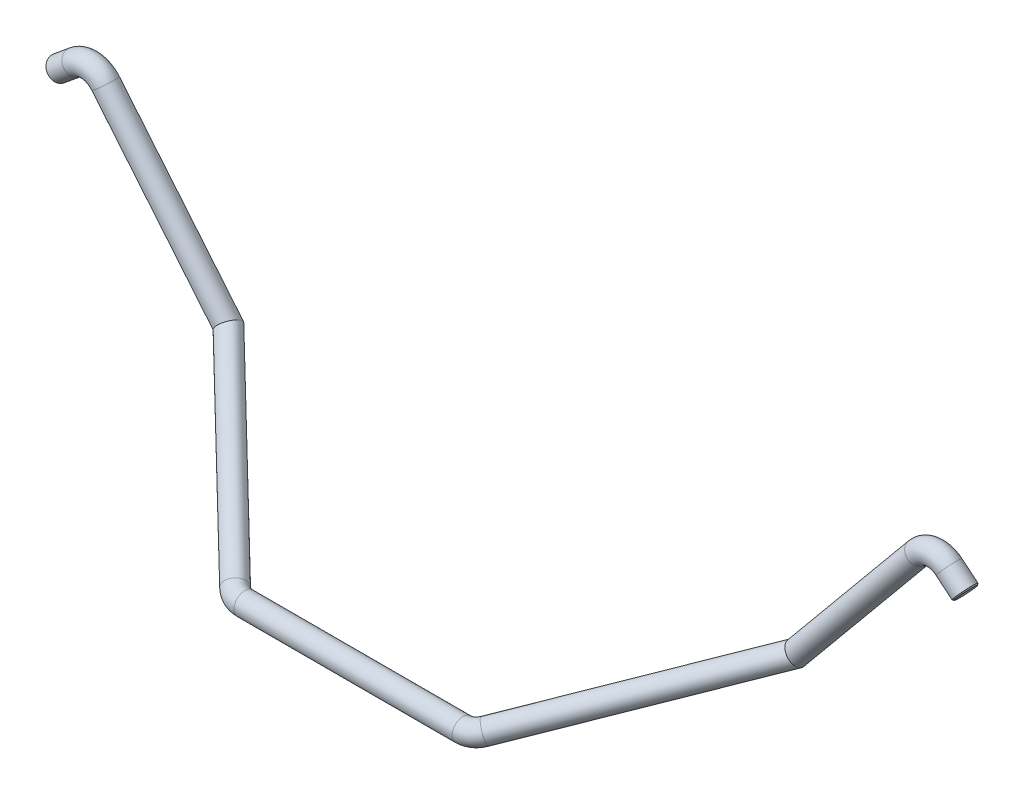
ISO-10303-21;
HEADER;
FILE_DESCRIPTION(('STEP AP214'),'2;1');
FILE_NAME('part.step','',(''),(''),'','','');
FILE_SCHEMA(('AUTOMOTIVE_DESIGN { 1 0 10303 214 1 1 1 1 }'));
ENDSEC;
DATA;
#1=APPLICATION_CONTEXT('core data for automotive mechanical design processes');
#2=APPLICATION_PROTOCOL_DEFINITION('international standard','automotive_design',2000,#1);
#3=PRODUCT_CONTEXT('',#1,'mechanical');
#4=PRODUCT('Part','Part','',(#3));
#5=PRODUCT_RELATED_PRODUCT_CATEGORY('part','',(#4));
#6=PRODUCT_DEFINITION_FORMATION('','',#4);
#7=PRODUCT_DEFINITION_CONTEXT('part definition',#1,'design');
#8=PRODUCT_DEFINITION('design','',#6,#7);
#9=PRODUCT_DEFINITION_SHAPE('','',#8);
#10=(LENGTH_UNIT() NAMED_UNIT(*) SI_UNIT(.MILLI.,.METRE.));
#11=(NAMED_UNIT(*) PLANE_ANGLE_UNIT() SI_UNIT($,.RADIAN.));
#12=(NAMED_UNIT(*) SI_UNIT($,.STERADIAN.) SOLID_ANGLE_UNIT());
#13=UNCERTAINTY_MEASURE_WITH_UNIT(LENGTH_MEASURE(1.E-05),#10,'distance_accuracy_value','');
#14=(GEOMETRIC_REPRESENTATION_CONTEXT(3) GLOBAL_UNCERTAINTY_ASSIGNED_CONTEXT((#13)) GLOBAL_UNIT_ASSIGNED_CONTEXT((#10,
#11,#12)) REPRESENTATION_CONTEXT('',''));
#15=CARTESIAN_POINT('',(0.,0.,0.));
#16=DIRECTION('',(0.,0.,1.));
#17=DIRECTION('',(1.,0.,0.));
#18=AXIS2_PLACEMENT_3D('',#15,#16,#17);
#19=CARTESIAN_POINT('',(-200.371713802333,69.427221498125,0.));
#20=DIRECTION('',(-0.770722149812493,-0.6371713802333,0.));
#21=DIRECTION('',(0.6371713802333,-0.770722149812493,0.));
#22=AXIS2_PLACEMENT_3D('',#19,#20,#21);
#23=CYLINDRICAL_SURFACE('',#22,5.);
#24=CARTESIAN_POINT('',(-207.693574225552,63.3740933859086,0.));
#25=DIRECTION('',(-0.770722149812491,-0.637171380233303,0.));
#26=DIRECTION('',(0.637171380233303,-0.770722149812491,0.));
#27=AXIS2_PLACEMENT_3D('',#24,#25,#26);
#28=CIRCLE('',#27,5.);
#29=CARTESIAN_POINT('',(-204.507717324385,59.5204826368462,0.));
#30=VERTEX_POINT('',#29);
#31=EDGE_CURVE('E34',#30,#30,#28,.F.);
#32=ORIENTED_EDGE('',*,*,#31,.T.);
#33=EDGE_LOOP('',(#32));
#34=FACE_BOUND('',#33,.T.);
#35=CARTESIAN_POINT('',(-200.371713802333,69.427221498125,0.));
#36=DIRECTION('',(-0.770722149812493,-0.6371713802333,0.));
#37=DIRECTION('',(0.6371713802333,-0.770722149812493,0.));
#38=AXIS2_PLACEMENT_3D('',#35,#36,#37);
#39=CIRCLE('',#38,5.);
#40=CARTESIAN_POINT('',(-203.5575707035,73.2808322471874,0.));
#41=VERTEX_POINT('',#40);
#42=EDGE_CURVE('E47',#41,#41,#39,.F.);
#43=ORIENTED_EDGE('',*,*,#42,.F.);
#44=EDGE_LOOP('',(#43));
#45=FACE_BOUND('',#44,.T.);
#46=ADVANCED_FACE('F28',(#34,#45),#23,.T.);
#47=CARTESIAN_POINT('',(-194.,61.72,0.));
#48=DIRECTION('',(0.,0.,1.));
#49=DIRECTION('',(1.,0.,0.));
#50=AXIS2_PLACEMENT_3D('',#47,#48,#49);
#51=TOROIDAL_SURFACE('',#50,10.,5.);
#52=CARTESIAN_POINT('',(-186.292778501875,68.091713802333,0.));
#53=DIRECTION('',(-0.637171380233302,0.770722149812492,0.));
#54=DIRECTION('',(-0.770722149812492,-0.637171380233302,0.));
#55=AXIS2_PLACEMENT_3D('',#52,#53,#54);
#56=CIRCLE('',#55,5.);
#57=CARTESIAN_POINT('',(-182.439167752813,71.2775707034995,0.));
#58=VERTEX_POINT('',#57);
#59=EDGE_CURVE('E50',#58,#58,#56,.F.);
#60=CARTESIAN_POINT('',(-194.,61.72,0.));
#61=DIRECTION('',(0.,0.,1.));
#62=DIRECTION('',(1.,0.,0.));
#63=AXIS2_PLACEMENT_3D('',#60,#61,#62);
#64=CIRCLE('',#63,15.);
#65=EDGE_CURVE('',#58,#41,#64,.T.);
#66=ORIENTED_EDGE('',*,*,#59,.F.);
#67=ORIENTED_EDGE('',*,*,#42,.T.);
#68=ORIENTED_EDGE('',*,*,#65,.T.);
#69=ORIENTED_EDGE('',*,*,#65,.F.);
#70=EDGE_LOOP('',(#66,#68,#67,#69));
#71=FACE_BOUND('',#70,.T.);
#72=ADVANCED_FACE('F125',(#71),#51,.T.);
#73=CARTESIAN_POINT('',(-130.,0.,0.));
#74=DIRECTION('',(-0.637171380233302,0.770722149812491,0.));
#75=DIRECTION('',(-0.770722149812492,-0.637171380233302,0.));
#76=AXIS2_PLACEMENT_3D('',#73,#74,#75);
#77=CYLINDRICAL_SURFACE('',#76,5.);
#78=CARTESIAN_POINT('',(-130.,0.,0.));
#79=DIRECTION('',(-0.723735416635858,0.588896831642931,-0.359732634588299));
#80=DIRECTION('',(-0.0621216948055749,-0.574775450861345,-0.815949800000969));
#81=AXIS2_PLACEMENT_3D('',#78,#79,#80);
#82=ELLIPSE('',#81,5.46436545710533,5.);
#83=CARTESIAN_POINT('',(-130.339455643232,-3.14078311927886,-4.4586479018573));
#84=VERTEX_POINT('',#83);
#85=EDGE_CURVE('E53',#84,#84,#82,.T.);
#86=ORIENTED_EDGE('',*,*,#85,.T.);
#87=EDGE_LOOP('',(#86));
#88=FACE_BOUND('',#87,.T.);
#89=ORIENTED_EDGE('',*,*,#59,.T.);
#90=EDGE_LOOP('',(#89));
#91=FACE_BOUND('',#90,.T.);
#92=ADVANCED_FACE('F119',(#88,#91),#77,.T.);
#93=CARTESIAN_POINT('',(-57.2638085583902,-32.4879015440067,69.670529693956));
#94=DIRECTION('',(-0.687292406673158,0.306981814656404,-0.658324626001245));
#95=DIRECTION('',(-0.69172426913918,0.,0.722161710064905));
#96=AXIS2_PLACEMENT_3D('',#93,#94,#95);
#97=CYLINDRICAL_SURFACE('',#96,5.);
#98=CARTESIAN_POINT('',(-57.2638085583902,-32.4879015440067,69.670529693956));
#99=DIRECTION('',(-0.687292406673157,0.306981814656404,-0.658324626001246));
#100=DIRECTION('',(-0.69172426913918,0.,0.722161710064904));
#101=AXIS2_PLACEMENT_3D('',#98,#99,#100);
#102=CIRCLE('',#101,5.);
#103=CARTESIAN_POINT('',(-60.8957128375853,-33.9402131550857,72.7850219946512));
#104=VERTEX_POINT('',#103);
#105=EDGE_CURVE('E56',#104,#104,#102,.F.);
#106=ORIENTED_EDGE('',*,*,#105,.F.);
#107=EDGE_LOOP('',(#106));
#108=FACE_BOUND('',#107,.T.);
#109=ORIENTED_EDGE('',*,*,#85,.F.);
#110=EDGE_LOOP('',(#109));
#111=FACE_BOUND('',#110,.T.);
#112=ADVANCED_FACE('F113',(#108,#111),#97,.T.);
#113=CARTESIAN_POINT('',(-50.,-29.5832783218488,63.4415450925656));
#114=DIRECTION('',(0.,-0.906307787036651,-0.422618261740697));
#115=DIRECTION('',(0.,0.422618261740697,-0.906307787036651));
#116=AXIS2_PLACEMENT_3D('',#113,#114,#115);
#117=TOROIDAL_SURFACE('',#116,10.,5.);
#118=CARTESIAN_POINT('',(-50.,-33.8094609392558,72.5046229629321));
#119=DIRECTION('',(-1.,0.,0.));
#120=DIRECTION('',(0.,-0.125850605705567,0.992049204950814));
#121=AXIS2_PLACEMENT_3D('',#118,#119,#120);
#122=CIRCLE('',#121,5.);
#123=CARTESIAN_POINT('',(-50.,-35.9225522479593,77.0361618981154));
#124=VERTEX_POINT('',#123);
#125=EDGE_CURVE('E59',#124,#124,#122,.F.);
#126=CARTESIAN_POINT('',(-50.,-29.5832783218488,63.4415450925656));
#127=DIRECTION('',(0.,-0.906307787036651,-0.422618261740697));
#128=DIRECTION('',(0.,0.422618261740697,-0.906307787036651));
#129=AXIS2_PLACEMENT_3D('',#126,#127,#128);
#130=CIRCLE('',#129,15.);
#131=EDGE_CURVE('',#124,#104,#130,.T.);
#132=ORIENTED_EDGE('',*,*,#125,.F.);
#133=ORIENTED_EDGE('',*,*,#105,.T.);
#134=ORIENTED_EDGE('',*,*,#131,.T.);
#135=ORIENTED_EDGE('',*,*,#131,.F.);
#136=EDGE_LOOP('',(#132,#134,#133,#135));
#137=FACE_BOUND('',#136,.T.);
#138=ADVANCED_FACE('F107',(#137),#117,.T.);
#139=CARTESIAN_POINT('',(50.,-33.8094609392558,72.5046229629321));
#140=DIRECTION('',(-1.,0.,0.));
#141=DIRECTION('',(0.,-1.,0.));
#142=AXIS2_PLACEMENT_3D('',#139,#140,#141);
#143=CYLINDRICAL_SURFACE('',#142,5.);
#144=CARTESIAN_POINT('',(50.,-33.8094609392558,72.5046229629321));
#145=DIRECTION('',(-1.,0.,0.));
#146=DIRECTION('',(0.,-0.125850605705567,0.992049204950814));
#147=AXIS2_PLACEMENT_3D('',#144,#145,#146);
#148=CIRCLE('',#147,5.);
#149=CARTESIAN_POINT('',(50.,-35.9225522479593,77.0361618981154));
#150=VERTEX_POINT('',#149);
#151=EDGE_CURVE('E62',#150,#150,#148,.F.);
#152=ORIENTED_EDGE('',*,*,#151,.F.);
#153=EDGE_LOOP('',(#152));
#154=FACE_BOUND('',#153,.T.);
#155=ORIENTED_EDGE('',*,*,#125,.T.);
#156=EDGE_LOOP('',(#155));
#157=FACE_BOUND('',#156,.T.);
#158=ADVANCED_FACE('F101',(#154,#157),#143,.T.);
#159=CARTESIAN_POINT('',(50.,-29.5832783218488,63.4415450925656));
#160=DIRECTION('',(0.,-0.906307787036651,-0.422618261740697));
#161=DIRECTION('',(0.,0.422618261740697,-0.906307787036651));
#162=AXIS2_PLACEMENT_3D('',#159,#160,#161);
#163=TOROIDAL_SURFACE('',#162,10.,5.);
#164=CARTESIAN_POINT('',(57.2638085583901,-32.4879015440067,69.670529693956));
#165=DIRECTION('',(-0.687292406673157,-0.306981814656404,0.658324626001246));
#166=DIRECTION('',(0.69172426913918,0.,0.722161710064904));
#167=AXIS2_PLACEMENT_3D('',#164,#165,#166);
#168=CIRCLE('',#167,5.);
#169=CARTESIAN_POINT('',(60.8957128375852,-33.9402131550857,72.7850219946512));
#170=VERTEX_POINT('',#169);
#171=EDGE_CURVE('E65',#170,#170,#168,.F.);
#172=CARTESIAN_POINT('',(50.,-29.5832783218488,63.4415450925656));
#173=DIRECTION('',(0.,-0.906307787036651,-0.422618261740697));
#174=DIRECTION('',(0.,0.422618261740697,-0.906307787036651));
#175=AXIS2_PLACEMENT_3D('',#172,#173,#174);
#176=CIRCLE('',#175,15.);
#177=EDGE_CURVE('',#170,#150,#176,.T.);
#178=ORIENTED_EDGE('',*,*,#171,.F.);
#179=ORIENTED_EDGE('',*,*,#151,.T.);
#180=ORIENTED_EDGE('',*,*,#177,.T.);
#181=ORIENTED_EDGE('',*,*,#177,.F.);
#182=EDGE_LOOP('',(#178,#180,#179,#181));
#183=FACE_BOUND('',#182,.T.);
#184=ADVANCED_FACE('F95',(#183),#163,.T.);
#185=CARTESIAN_POINT('',(130.,0.,0.));
#186=DIRECTION('',(-0.687292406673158,-0.306981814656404,0.658324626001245));
#187=DIRECTION('',(0.69172426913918,0.,0.722161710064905));
#188=AXIS2_PLACEMENT_3D('',#185,#186,#187);
#189=CYLINDRICAL_SURFACE('',#188,5.);
#190=CARTESIAN_POINT('',(130.,0.,0.));
#191=DIRECTION('',(-0.723735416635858,-0.58889683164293,0.359732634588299));
#192=DIRECTION('',(0.0621216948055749,-0.574775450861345,-0.815949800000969));
#193=AXIS2_PLACEMENT_3D('',#190,#191,#192);
#194=ELLIPSE('',#193,5.46436545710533,5.);
#195=CARTESIAN_POINT('',(130.339455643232,-3.14078311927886,-4.45864790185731));
#196=VERTEX_POINT('',#195);
#197=EDGE_CURVE('E68',#196,#196,#194,.T.);
#198=ORIENTED_EDGE('',*,*,#197,.T.);
#199=EDGE_LOOP('',(#198));
#200=FACE_BOUND('',#199,.T.);
#201=ORIENTED_EDGE('',*,*,#171,.T.);
#202=EDGE_LOOP('',(#201));
#203=FACE_BOUND('',#202,.T.);
#204=ADVANCED_FACE('F89',(#200,#203),#189,.T.);
#205=CARTESIAN_POINT('',(186.292778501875,68.0917138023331,0.));
#206=DIRECTION('',(-0.637171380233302,-0.770722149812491,0.));
#207=DIRECTION('',(0.770722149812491,-0.637171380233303,0.));
#208=AXIS2_PLACEMENT_3D('',#205,#206,#207);
#209=CYLINDRICAL_SURFACE('',#208,5.);
#210=CARTESIAN_POINT('',(186.292778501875,68.0917138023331,0.));
#211=DIRECTION('',(0.637171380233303,0.770722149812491,0.));
#212=DIRECTION('',(-0.770722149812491,0.637171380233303,0.));
#213=AXIS2_PLACEMENT_3D('',#210,#211,#212);
#214=CIRCLE('',#213,5.);
#215=CARTESIAN_POINT('',(182.439167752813,71.2775707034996,0.));
#216=VERTEX_POINT('',#215);
#217=EDGE_CURVE('E71',#216,#216,#214,.T.);
#218=ORIENTED_EDGE('',*,*,#217,.F.);
#219=EDGE_LOOP('',(#218));
#220=FACE_BOUND('',#219,.T.);
#221=ORIENTED_EDGE('',*,*,#197,.F.);
#222=EDGE_LOOP('',(#221));
#223=FACE_BOUND('',#222,.T.);
#224=ADVANCED_FACE('F83',(#220,#223),#209,.T.);
#225=CARTESIAN_POINT('',(194.,61.72,0.));
#226=DIRECTION('',(0.,0.,1.));
#227=DIRECTION('',(1.,0.,0.));
#228=AXIS2_PLACEMENT_3D('',#225,#226,#227);
#229=TOROIDAL_SURFACE('',#228,10.,5.);
#230=CARTESIAN_POINT('',(200.371713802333,69.4272214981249,0.));
#231=DIRECTION('',(0.77072214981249,-0.637171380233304,0.));
#232=DIRECTION('',(0.637171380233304,0.77072214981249,0.));
#233=AXIS2_PLACEMENT_3D('',#230,#231,#232);
#234=CIRCLE('',#233,5.);
#235=CARTESIAN_POINT('',(203.5575707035,73.2808322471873,0.));
#236=VERTEX_POINT('',#235);
#237=EDGE_CURVE('E74',#236,#236,#234,.T.);
#238=CARTESIAN_POINT('',(194.,61.72,0.));
#239=DIRECTION('',(0.,0.,1.));
#240=DIRECTION('',(1.,0.,0.));
#241=AXIS2_PLACEMENT_3D('',#238,#239,#240);
#242=CIRCLE('',#241,15.);
#243=EDGE_CURVE('',#236,#216,#242,.T.);
#244=ORIENTED_EDGE('',*,*,#237,.F.);
#245=ORIENTED_EDGE('',*,*,#217,.T.);
#246=ORIENTED_EDGE('',*,*,#243,.T.);
#247=ORIENTED_EDGE('',*,*,#243,.F.);
#248=EDGE_LOOP('',(#244,#246,#245,#247));
#249=FACE_BOUND('',#248,.T.);
#250=ADVANCED_FACE('F80',(#249),#229,.T.);
#251=CARTESIAN_POINT('',(200.371713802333,69.4272214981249,0.));
#252=DIRECTION('',(0.770722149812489,-0.637171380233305,0.));
#253=DIRECTION('',(0.637171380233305,0.770722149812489,0.));
#254=AXIS2_PLACEMENT_3D('',#251,#252,#253);
#255=CYLINDRICAL_SURFACE('',#254,5.);
#256=CARTESIAN_POINT('',(207.693574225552,63.3740933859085,0.));
#257=DIRECTION('',(0.770722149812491,-0.637171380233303,0.));
#258=DIRECTION('',(0.637171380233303,0.770722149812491,0.));
#259=AXIS2_PLACEMENT_3D('',#256,#257,#258);
#260=CIRCLE('',#259,5.);
#261=CARTESIAN_POINT('',(210.879431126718,67.2277041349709,0.));
#262=VERTEX_POINT('',#261);
#263=EDGE_CURVE('E38',#262,#262,#260,.F.);
#264=ORIENTED_EDGE('',*,*,#263,.T.);
#265=EDGE_LOOP('',(#264));
#266=FACE_BOUND('',#265,.T.);
#267=ORIENTED_EDGE('',*,*,#237,.T.);
#268=EDGE_LOOP('',(#267));
#269=FACE_BOUND('',#268,.T.);
#270=ADVANCED_FACE('F78',(#266,#269),#255,.T.);
#271=CARTESIAN_POINT('',(208.078935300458,63.0555076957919,0.));
#272=DIRECTION('',(0.77072214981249,-0.637171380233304,0.));
#273=DIRECTION('',(0.637171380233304,0.77072214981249,0.));
#274=AXIS2_PLACEMENT_3D('',#271,#272,#273);
#275=PLANE('',#274);
#276=CARTESIAN_POINT('',(208.078935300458,63.0555076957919,0.));
#277=DIRECTION('',(0.77072214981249,-0.637171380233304,0.));
#278=DIRECTION('',(0.637171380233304,0.77072214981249,0.));
#279=AXIS2_PLACEMENT_3D('',#276,#277,#278);
#280=CIRCLE('',#279,4.49999999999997);
#281=CARTESIAN_POINT('',(210.946206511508,66.523757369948,0.));
#282=VERTEX_POINT('',#281);
#283=EDGE_CURVE('E42',#282,#282,#280,.T.);
#284=ORIENTED_EDGE('',*,*,#283,.T.);
#285=EDGE_LOOP('',(#284));
#286=FACE_BOUND('',#285,.T.);
#287=ADVANCED_FACE('F178',(#286),#275,.T.);
#288=CARTESIAN_POINT('',(-208.078935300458,63.055507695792,0.));
#289=DIRECTION('',(-0.770722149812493,-0.6371713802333,0.));
#290=DIRECTION('',(0.6371713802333,-0.770722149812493,0.));
#291=AXIS2_PLACEMENT_3D('',#288,#289,#290);
#292=PLANE('',#291);
#293=CARTESIAN_POINT('',(-208.078935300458,63.055507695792,0.));
#294=DIRECTION('',(-0.770722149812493,-0.6371713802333,0.));
#295=DIRECTION('',(0.6371713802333,-0.770722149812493,0.));
#296=AXIS2_PLACEMENT_3D('',#293,#294,#295);
#297=CIRCLE('',#296,4.49999999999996);
#298=CARTESIAN_POINT('',(-205.211664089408,59.5872580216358,0.));
#299=VERTEX_POINT('',#298);
#300=EDGE_CURVE('E10',#299,#299,#297,.T.);
#301=ORIENTED_EDGE('',*,*,#300,.T.);
#302=EDGE_LOOP('',(#301));
#303=FACE_BOUND('',#302,.T.);
#304=ADVANCED_FACE('F186',(#303),#292,.T.);
#305=CARTESIAN_POINT('',(208.078935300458,63.0555076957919,0.));
#306=DIRECTION('',(-0.770722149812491,0.637171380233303,0.));
#307=DIRECTION('',(-0.637171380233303,-0.770722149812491,0.));
#308=AXIS2_PLACEMENT_3D('',#305,#306,#307);
#309=CONICAL_SURFACE('',#308,4.49999999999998,0.785398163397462);
#310=ORIENTED_EDGE('',*,*,#263,.F.);
#311=EDGE_LOOP('',(#310));
#312=FACE_BOUND('',#311,.T.);
#313=ORIENTED_EDGE('',*,*,#283,.F.);
#314=EDGE_LOOP('',(#313));
#315=FACE_BOUND('',#314,.T.);
#316=ADVANCED_FACE('F194',(#312,#315),#309,.T.);
#317=CARTESIAN_POINT('',(-207.693574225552,63.3740933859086,0.));
#318=DIRECTION('',(0.770722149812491,0.637171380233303,0.));
#319=DIRECTION('',(-0.637171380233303,0.770722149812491,0.));
#320=AXIS2_PLACEMENT_3D('',#317,#318,#319);
#321=CONICAL_SURFACE('',#320,5.,0.785398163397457);
#322=ORIENTED_EDGE('',*,*,#300,.F.);
#323=EDGE_LOOP('',(#322));
#324=FACE_BOUND('',#323,.T.);
#325=ORIENTED_EDGE('',*,*,#31,.F.);
#326=EDGE_LOOP('',(#325));
#327=FACE_BOUND('',#326,.T.);
#328=ADVANCED_FACE('F201',(#324,#327),#321,.T.);
#329=CLOSED_SHELL('',(#46,#72,#92,#112,#138,#158,#184,#204,#224,#250,#270,#287,#304,#316,#328));
#330=MANIFOLD_SOLID_BREP('B2',#329);
#331=ADVANCED_BREP_SHAPE_REPRESENTATION('',(#18,#330),#14);
#332=SHAPE_DEFINITION_REPRESENTATION(#9,#331);
ENDSEC;
END-ISO-10303-21;
